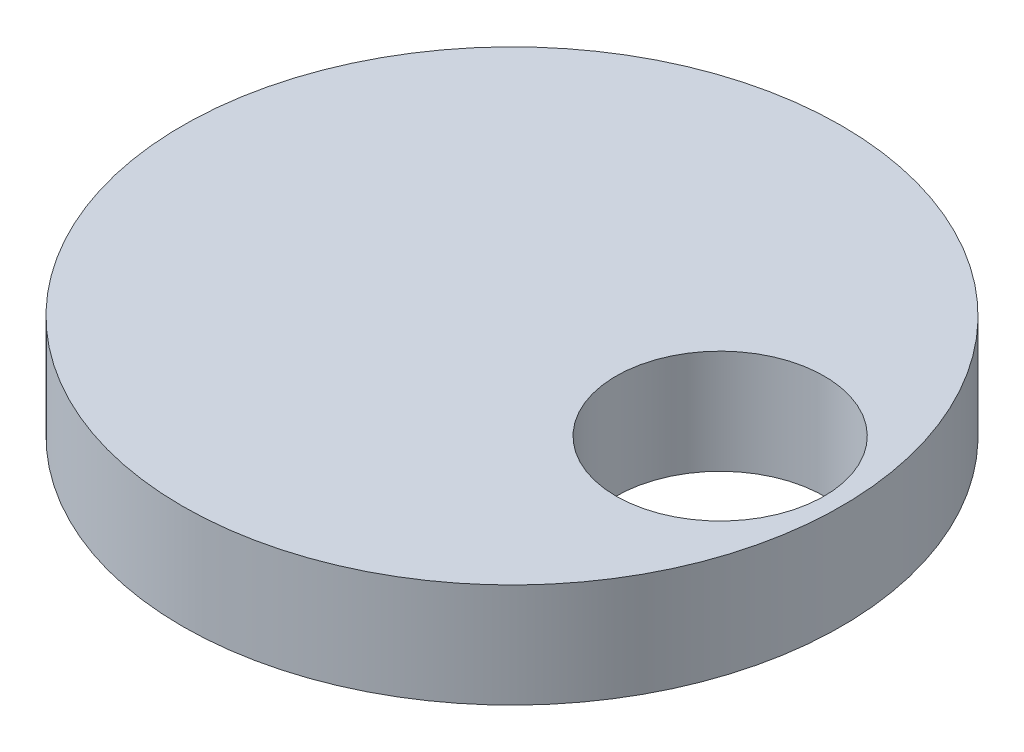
from build123d import *

# Parameters (mm, degrees)
SKETCH1_R      = 9.5
SKETCH1_R_2    = 3
EXTRUDE1_DEPTH = 3


with BuildPart() as part:
    # Sketch1 → Extrude1 (new body)
    with BuildSketch(Plane(origin=(0, 0, 0), x_dir=(1, 0, 0), z_dir=(0, 1, 0))):
        with Locations(Location((0, 0, 0), (0, 0, 270))):
            Circle(SKETCH1_R)
        with Locations(Location((6, 0, 0), (0, 0, 270))):
            Circle(SKETCH1_R_2, mode=Mode.SUBTRACT)
    extrude(amount=EXTRUDE1_DEPTH)


solid = part.part
